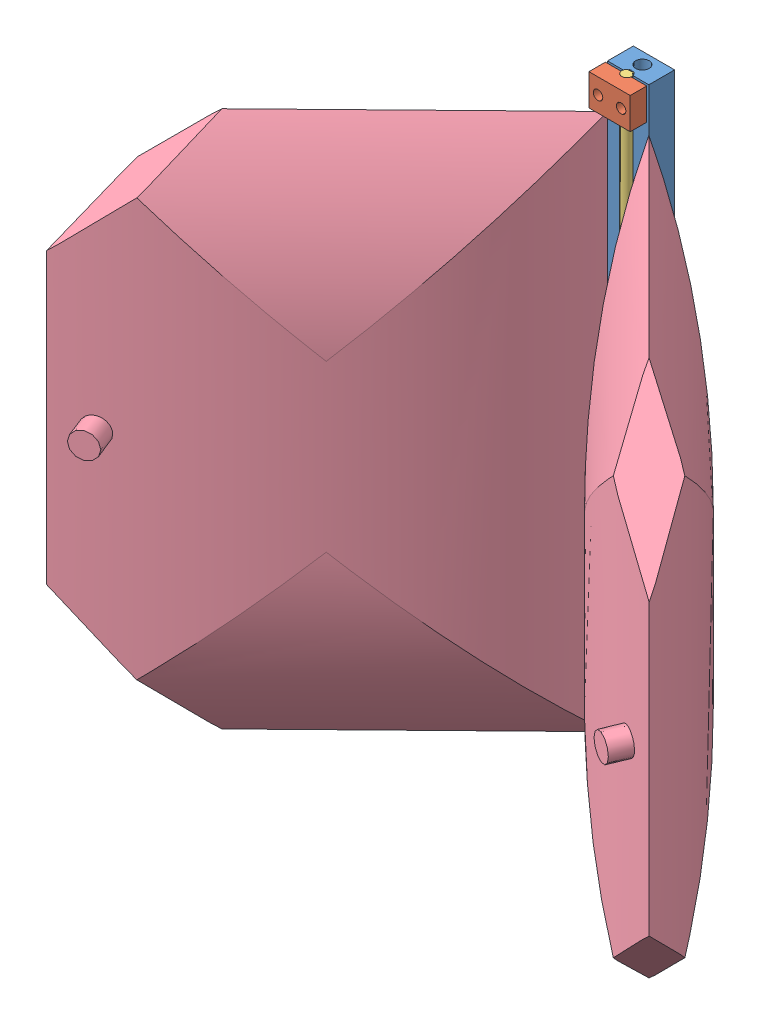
SolidWorks assembly int_res.SLDASM, configuration Default (file format 3400). Lengths in mm.
Overall size (227.66 206.38 203.42).
5 component instances, 4 part files, 7 mates.
Components (placement in the parent):
- GHM-8235 INTERNAL RESERVOIR BAR-1: GHM-8235 INTERNAL RESERVOIR BAR.SLDPRT [Default] at origin size (12.7 127 7.94)
- GHM-8245 INTERNAL RESERVOIR SPLIT CLAMP-1: GHM-8245 INTERNAL RESERVOIR SPLIT CLAMP.SLDPRT [Default] at (12.7 117.348 0.635) x (-1 0 0) z (0 0 -1) size (12.7 9.65 5.08)
- GHM-8235 INTERNAL RESERVOIR BENT ROD-1: GHM-8235 INTERNAL RESERVOIR BENT ROD.SLDPRT [Default] at (6.35 127 0.381) x (0 -1 0) z (0 0 1) size (206.38 3.17 6.35)
- int_res1-1: int_res1.SLDPRT [Default] at (55.8308 -51.5087 43.0796) x (0.706686 0 -0.707527) z (0 1 0) size (58.97 121.92 165.1)
- int_res1-2: int_res1.SLDPRT [Default] at (-43.6379 113.538 42.5659) x (-0.698259 0 -0.715845) z (0 -1 0) size (58.97 121.92 165.1)
Mates (geometry in assembly coordinates):
- Coincident2: coincident anti-aligned: plane of ? through (7.8642 133.5166 -0.0034) normal (0 1 0); circle of ?
- Coincident4: coincident aligned: line of GHM-8235 INTERNAL RESERVOIR BAR-1; line of ?
- Coincident5: coincident anti-aligned: line of GHM-8235 INTERNAL RESERVOIR BAR-1; line of int_res1-2
- Distance3: distance = 3.81 mm: point of GHM-8245 INTERNAL RESERVOIR SPLIT CLAMP-1; point of int_res1-1
- Concentric1: concentric anti-aligned: circle of ?; circle of ?
- Concentric2: concentric anti-aligned: cylinder of ?; cylinder of ?
- Concentric3: concentric = 183.3023 mm aligned: 
